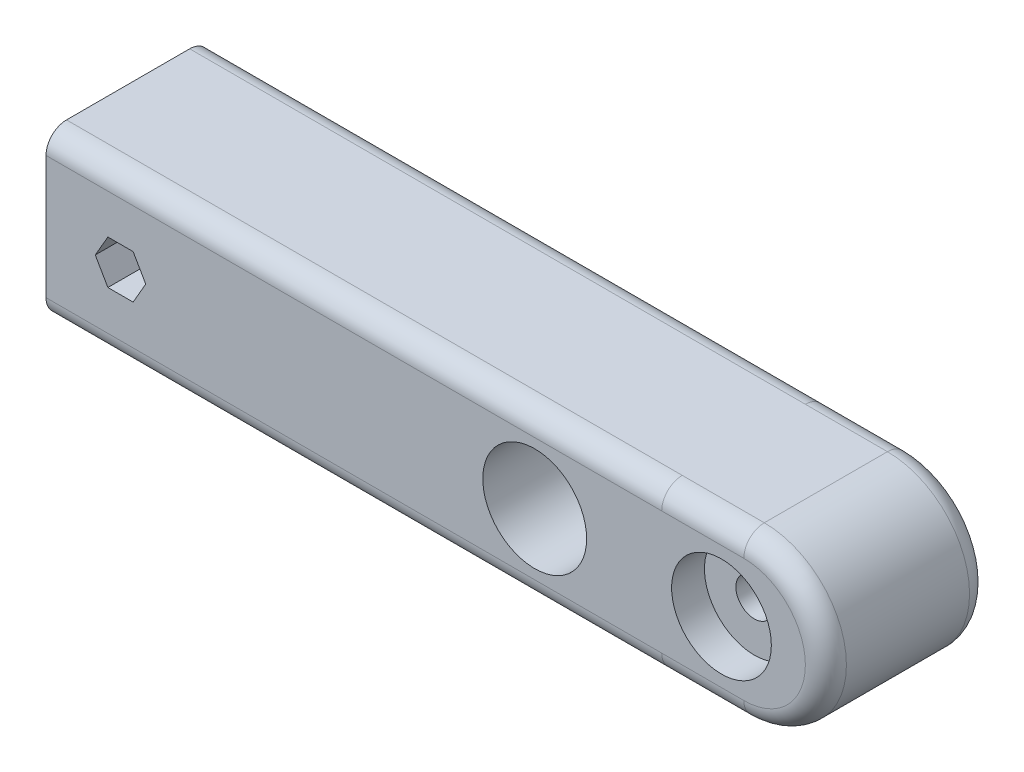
from build123d import *

# Parameters (mm, degrees)
CROQUIS1_W              = 150
CROQUIS1_H              = 40
SALIENTE_EXTRUIR1_DEPTH = 40
REDONDEO2_R             = 5
REDONDEO3_R             = 5
CORTAR_EXTRUIR2_DEPTH   = 86
CROQUIS7_R              = 12.65
CORTAR_EXTRUIR4_DEPTH   = 72
SALIENTE_EXTRUIR2_DEPTH = 40
REDONDEO4_R             = 5
CROQUIS10_R             = 4.5
CORTAR_EXTRUIR5_DEPTH   = 60
CROQUIS12_R             = 12.15
CORTAR_EXTRUIR6_DEPTH   = 8
CORTAR_EXTRUIR7_START   = -8
CROQUIS13_R             = 12.15
CORTAR_EXTRUIR7_DEPTH   = 8
CROQUIS14_R             = 12.15
CORTAR_EXTRUIR8_DEPTH   = 8


with BuildPart() as part:
    # Croquis1 → Saliente-Extruir1 (new body)
    with BuildSketch(Plane(origin=(0, 0, 0), x_dir=(1, 0, 0), z_dir=(0, 1, 0))):
        with Locations((75, -20)):
            Rectangle(CROQUIS1_W, CROQUIS1_H)
    extrude(amount=SALIENTE_EXTRUIR1_DEPTH)

    # Redondeo2
    redondeo2_edges = [part.edges().sort_by_distance(p)[0] for p in [
        (75, 0, 0),
    ]]
    fillet(redondeo2_edges, radius=REDONDEO2_R)

    # Redondeo3
    redondeo3_edges = [part.edges().sort_by_distance(p)[0] for p in [
        (75, 40, 0),
        (75, 0, 40),
        (75, 40, 40),
    ]]
    fillet(redondeo3_edges, radius=REDONDEO3_R)

    # Croquis6 → Cortar-Extruir2 (cut)
    with BuildSketch(Plane(origin=(0, 0, 0), x_dir=(-1, 0, 0), z_dir=(0, 0, -1))):
        Polygon((-15.075, 14.673943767), (-12, 20), (-15.075, 25.326056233), (-21.225, 25.326056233), (-24.3, 20), (-21.225, 14.673943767), align=None)
    extrude(amount=-CORTAR_EXTRUIR2_DEPTH, mode=Mode.SUBTRACT)

    # Croquis7 → Cortar-Extruir4 (cut)
    with BuildSketch(Plane.XY.offset(40)):
        with Locations((119.05843723, 20)):
            Circle(CROQUIS7_R)
    extrude(amount=-CORTAR_EXTRUIR4_DEPTH, mode=Mode.SUBTRACT)

    # Croquis9 → Saliente-Extruir2 (add)
    with BuildSketch(Plane.XY.offset(40)):
        with BuildLine():
            Line((150, 40), (170, 40))
            ThreePointArc((170, 40), (190, 20), (170, 0))
            Line((170, 0), (150, 0))
            Line((150, 0), (150, 40))
        make_face()
    extrude(amount=-SALIENTE_EXTRUIR2_DEPTH)

    # Redondeo4
    redondeo4_edges = [part.edges().sort_by_distance(p)[0] for p in [
        (160, 40, 0),
        (190, 20, 40),
        (190, 20, 0),
        (160, 0, 0),
        (160, 40, 40),
        (160, 0, 40),
    ]]
    fillet(redondeo4_edges, radius=REDONDEO4_R)

    # Croquis10 → Cortar-Extruir5 (cut)
    with BuildSketch(Plane.XY.offset(40)):
        with Locations((164.56347457, 20)):
            Circle(CROQUIS10_R)
    extrude(amount=-CORTAR_EXTRUIR5_DEPTH, mode=Mode.SUBTRACT)

    # Croquis12 → Cortar-Extruir6 (cut)
    with BuildSketch(Plane.XY.offset(40)):
        with Locations((164.56347457, 20)):
            Circle(CROQUIS12_R)
    extrude(amount=-CORTAR_EXTRUIR6_DEPTH, mode=Mode.SUBTRACT)

    # Croquis13 → Cortar-Extruir7 (cut)
    with BuildSketch(Plane(origin=(0, 0, 0), x_dir=(-1, 0, 0), z_dir=(0, 0, -1)).offset(CORTAR_EXTRUIR7_START)):
        with Locations(Location((-164.56347457, 20, 0), (0, 0, 180))):
            Circle(CROQUIS13_R)
    extrude(amount=CORTAR_EXTRUIR7_DEPTH, mode=Mode.SUBTRACT)

    # Croquis14 → Cortar-Extruir8 (cut)
    with BuildSketch(Plane(origin=(0, 0, 0), x_dir=(-1, 0, 0), z_dir=(0, 0, -1))):
        with Locations((-18.209933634, 19.940768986)):
            Circle(CROQUIS14_R)
    extrude(amount=-CORTAR_EXTRUIR8_DEPTH, mode=Mode.SUBTRACT)


solid = part.part
